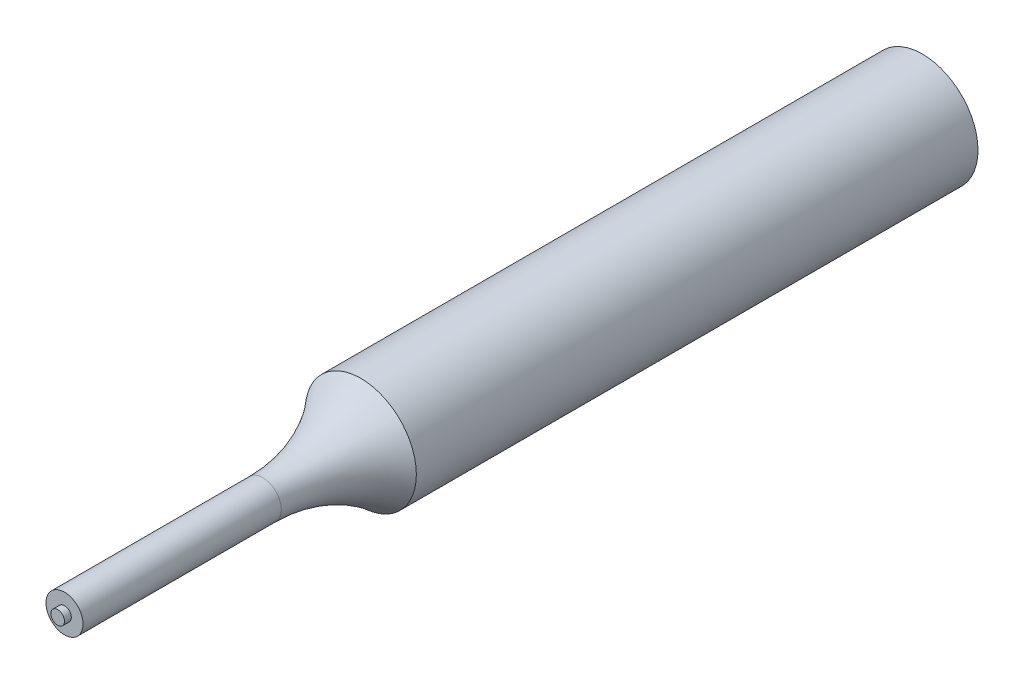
ISO-10303-21;
HEADER;
FILE_DESCRIPTION(('STEP AP214'),'2;1');
FILE_NAME('part.step','',(''),(''),'','','');
FILE_SCHEMA(('AUTOMOTIVE_DESIGN { 1 0 10303 214 1 1 1 1 }'));
ENDSEC;
DATA;
#1=APPLICATION_CONTEXT('core data for automotive mechanical design processes');
#2=APPLICATION_PROTOCOL_DEFINITION('international standard','automotive_design',2000,#1);
#3=PRODUCT_CONTEXT('',#1,'mechanical');
#4=PRODUCT('Part','Part','',(#3));
#5=PRODUCT_RELATED_PRODUCT_CATEGORY('part','',(#4));
#6=PRODUCT_DEFINITION_FORMATION('','',#4);
#7=PRODUCT_DEFINITION_CONTEXT('part definition',#1,'design');
#8=PRODUCT_DEFINITION('design','',#6,#7);
#9=PRODUCT_DEFINITION_SHAPE('','',#8);
#10=(LENGTH_UNIT() NAMED_UNIT(*) SI_UNIT(.MILLI.,.METRE.));
#11=(NAMED_UNIT(*) PLANE_ANGLE_UNIT() SI_UNIT($,.RADIAN.));
#12=(NAMED_UNIT(*) SI_UNIT($,.STERADIAN.) SOLID_ANGLE_UNIT());
#13=UNCERTAINTY_MEASURE_WITH_UNIT(LENGTH_MEASURE(1.E-05),#10,'distance_accuracy_value','');
#14=(GEOMETRIC_REPRESENTATION_CONTEXT(3) GLOBAL_UNCERTAINTY_ASSIGNED_CONTEXT((#13)) GLOBAL_UNIT_ASSIGNED_CONTEXT((#10,
#11,#12)) REPRESENTATION_CONTEXT('',''));
#15=CARTESIAN_POINT('',(0.,0.,0.));
#16=DIRECTION('',(0.,0.,1.));
#17=DIRECTION('',(1.,0.,0.));
#18=AXIS2_PLACEMENT_3D('',#15,#16,#17);
#19=CARTESIAN_POINT('',(-4.7625,0.,6.35));
#20=DIRECTION('',(0.,0.,1.));
#21=DIRECTION('',(1.,0.,0.));
#22=AXIS2_PLACEMENT_3D('',#19,#20,#21);
#23=PLANE('',#22);
#24=CARTESIAN_POINT('',(0.,0.,6.35));
#25=DIRECTION('',(0.,0.,1.));
#26=DIRECTION('',(1.,0.,0.));
#27=AXIS2_PLACEMENT_3D('',#24,#25,#26);
#28=CIRCLE('',#27,4.7625);
#29=CARTESIAN_POINT('',(4.7625,0.,6.35));
#30=VERTEX_POINT('',#29);
#31=EDGE_CURVE('E64',#30,#30,#28,.T.);
#32=ORIENTED_EDGE('',*,*,#31,.F.);
#33=EDGE_LOOP('',(#32));
#34=FACE_BOUND('',#33,.T.);
#35=ADVANCED_FACE('F41',(#34),#23,.F.);
#36=CARTESIAN_POINT('',(0.,0.,43.5171681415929));
#37=DIRECTION('',(0.,0.,1.));
#38=DIRECTION('',(1.,0.,0.));
#39=AXIS2_PLACEMENT_3D('',#36,#37,#38);
#40=CYLINDRICAL_SURFACE('',#39,4.7625);
#41=CARTESIAN_POINT('',(-4.00248276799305,-2.58099553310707,25.5899742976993));
#42=CARTESIAN_POINT('',(-4.02522274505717,-2.54572828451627,25.4458852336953));
#43=CARTESIAN_POINT('',(-4.04766248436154,-2.50991005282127,25.3018835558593));
#44=CARTESIAN_POINT('',(-4.09193875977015,-2.43706039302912,25.0140898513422));
#45=CARTESIAN_POINT('',(-4.11377527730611,-2.40002892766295,24.8702978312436));
#46=CARTESIAN_POINT('',(-4.17842422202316,-2.2868629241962,24.4389656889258));
#47=CARTESIAN_POINT('',(-4.22032281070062,-2.20873878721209,24.1518068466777));
#48=CARTESIAN_POINT('',(-4.30289135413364,-2.04337310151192,23.5701936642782));
#49=CARTESIAN_POINT('',(-4.34348400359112,-1.95592516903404,23.2757862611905));
#50=CARTESIAN_POINT('',(-4.4023152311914,-1.81755804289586,22.8362623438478));
#51=CARTESIAN_POINT('',(-4.42157721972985,-1.77025171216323,22.6901456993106));
#52=CARTESIAN_POINT('',(-4.45939906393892,-1.67269546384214,22.3988113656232));
#53=CARTESIAN_POINT('',(-4.47795895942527,-1.6224457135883,22.2535936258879));
#54=CARTESIAN_POINT('',(-4.51421091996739,-1.51865377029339,21.9654674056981));
#55=CARTESIAN_POINT('',(-4.53190845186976,-1.46513911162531,21.8225497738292));
#56=CARTESIAN_POINT('',(-4.5665462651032,-1.35332620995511,21.5383567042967));
#57=CARTESIAN_POINT('',(-4.58348590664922,-1.29502403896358,21.3970827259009));
#58=CARTESIAN_POINT('',(-4.61637705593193,-1.17239285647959,21.1183156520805));
#59=CARTESIAN_POINT('',(-4.63233524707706,-1.10811446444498,20.9808016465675));
#60=CARTESIAN_POINT('',(-4.65547688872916,-1.00457578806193,20.7781751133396));
#61=CARTESIAN_POINT('',(-4.66305359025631,-0.968901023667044,20.7112817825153));
#62=CARTESIAN_POINT('',(-4.67789630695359,-0.894504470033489,20.5791865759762));
#63=CARTESIAN_POINT('',(-4.68516243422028,-0.8557837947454,20.5139840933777));
#64=CARTESIAN_POINT('',(-4.69900506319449,-0.77609500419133,20.3887909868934));
#65=CARTESIAN_POINT('',(-4.70559777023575,-0.735293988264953,20.3286967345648));
#66=CARTESIAN_POINT('',(-4.7183147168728,-0.648721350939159,20.2119385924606));
#67=CARTESIAN_POINT('',(-4.72443847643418,-0.602944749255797,20.1552782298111));
#68=CARTESIAN_POINT('',(-4.73461183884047,-0.516039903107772,20.0605266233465));
#69=CARTESIAN_POINT('',(-4.73881233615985,-0.476312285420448,20.0211841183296));
#70=CARTESIAN_POINT('',(-4.74655370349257,-0.391706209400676,19.9483523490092));
#71=CARTESIAN_POINT('',(-4.75009652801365,-0.346843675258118,19.9148457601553));
#72=CARTESIAN_POINT('',(-4.75485366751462,-0.271185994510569,19.8697074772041));
#73=CARTESIAN_POINT('',(-4.75642103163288,-0.24239522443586,19.8547986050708));
#74=CARTESIAN_POINT('',(-4.75908055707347,-0.182874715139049,19.8294654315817));
#75=CARTESIAN_POINT('',(-4.76017339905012,-0.152147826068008,19.8190347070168));
#76=CARTESIAN_POINT('',(-4.7617760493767,-0.0888993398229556,19.8037279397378));
#77=CARTESIAN_POINT('',(-4.7622789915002,-0.0563611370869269,19.7989173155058));
#78=CARTESIAN_POINT('',(-4.76260340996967,0.00902995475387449,19.7958150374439));
#79=CARTESIAN_POINT('',(-4.76242519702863,0.0418826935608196,19.7975204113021));
#80=CARTESIAN_POINT('',(-4.76148382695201,0.102334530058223,19.8065183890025));
#81=CARTESIAN_POINT('',(-4.76080084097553,0.130055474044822,19.8130451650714));
#82=CARTESIAN_POINT('',(-4.7590133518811,0.184209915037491,19.8301024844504));
#83=CARTESIAN_POINT('',(-4.75790856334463,0.210642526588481,19.8406357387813));
#84=CARTESIAN_POINT('',(-4.75451686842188,0.278927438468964,19.8729125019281));
#85=CARTESIAN_POINT('',(-4.75193127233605,0.319424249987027,19.8974639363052));
#86=CARTESIAN_POINT('',(-4.74613891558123,0.396318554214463,19.9522424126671));
#87=CARTESIAN_POINT('',(-4.74293008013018,0.432701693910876,19.9824884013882));
#88=CARTESIAN_POINT('',(-4.73499245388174,0.513203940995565,20.0569725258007));
#89=CARTESIAN_POINT('',(-4.73010748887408,0.556026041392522,20.1025746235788));
#90=CARTESIAN_POINT('',(-4.71986086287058,0.637172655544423,20.1976168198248));
#91=CARTESIAN_POINT('',(-4.71449821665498,0.675487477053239,20.2470648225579));
#92=CARTESIAN_POINT('',(-4.70340177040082,0.748866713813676,20.3487083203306));
#93=CARTESIAN_POINT('',(-4.69766592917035,0.78391015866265,20.400918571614));
#94=CARTESIAN_POINT('',(-4.68593561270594,0.851218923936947,20.5069737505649));
#95=CARTESIAN_POINT('',(-4.67994141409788,0.883487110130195,20.5608169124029));
#96=CARTESIAN_POINT('',(-4.66114450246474,0.979561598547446,20.7285108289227));
#97=CARTESIAN_POINT('',(-4.64798059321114,1.0397891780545,20.8443637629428));
#98=CARTESIAN_POINT('',(-4.62093036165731,1.15404642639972,21.0790294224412));
#99=CARTESIAN_POINT('',(-4.60704349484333,1.20807132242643,21.1978443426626));
#100=CARTESIAN_POINT('',(-4.57861833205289,1.31169886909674,21.4376273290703));
#101=CARTESIAN_POINT('',(-4.56407861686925,1.36129110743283,21.558599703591));
#102=CARTESIAN_POINT('',(-4.53443167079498,1.45699481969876,21.8018508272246));
#103=CARTESIAN_POINT('',(-4.51932436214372,1.50310581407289,21.9241297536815));
#104=CARTESIAN_POINT('',(-4.47317602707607,1.63741284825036,22.2925795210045));
#105=CARTESIAN_POINT('',(-4.44133411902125,1.7214933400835,22.5401476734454));
#106=CARTESIAN_POINT('',(-4.37570545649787,1.88203802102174,23.0370801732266));
#107=CARTESIAN_POINT('',(-4.34192128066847,1.95851195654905,23.2864417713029));
#108=CARTESIAN_POINT('',(-4.2834523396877,2.08243229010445,23.7072575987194));
#109=CARTESIAN_POINT('',(-4.25927962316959,2.13139306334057,23.8783397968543));
#110=CARTESIAN_POINT('',(-4.21004355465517,2.22706881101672,24.2210676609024));
#111=CARTESIAN_POINT('',(-4.1849798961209,2.27378299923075,24.3927135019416));
#112=CARTESIAN_POINT('',(-4.1341642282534,2.36490929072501,24.7351547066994));
#113=CARTESIAN_POINT('',(-4.1084185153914,2.40933561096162,24.9059472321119));
#114=CARTESIAN_POINT('',(-4.05608365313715,2.496429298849,25.2477782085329));
#115=CARTESIAN_POINT('',(-4.02949484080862,2.53909735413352,25.4188165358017));
#116=CARTESIAN_POINT('',(-4.00248276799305,2.58099553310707,25.5899742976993));
#117=B_SPLINE_CURVE_WITH_KNOTS('',3,(#41,#42,#43,#44,#45,#46,#47,#48,#49,#50,#51,#52,#53,#54,
#55,#56,#57,#58,#59,#60,#61,#62,#63,#64,#65,#66,#67,#68,#69,#70,#71,#72,#73,#74,#75,#76,#77,#78,
#79,#80,#81,#82,#83,#84,#85,#86,#87,#88,#89,#90,#91,#92,#93,#94,#95,#96,#97,#98,#99,#100,#101,
#102,#103,#104,#105,#106,#107,#108,#109,#110,#111,#112,#113,#114,#115,#116),.UNSPECIFIED.,.F.,
.F.,(4,2,2,2,2,2,2,2,2,2,2,2,2,2,2,2,2,2,2,2,2,2,2,2,2,2,2,2,2,2,2,2,2,2,2,2,2,4),(0.,
0.450223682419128,0.90046120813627,1.80198981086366,2.73121839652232,3.19555454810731,
3.65986432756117,4.12069011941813,4.58189785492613,5.0395039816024,5.26801623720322,
5.49644530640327,5.71509848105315,5.93397256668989,6.10186830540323,6.269256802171,
6.36634972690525,6.46330291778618,6.5613737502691,6.65939985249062,6.74450925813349,
6.82967635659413,6.97113428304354,7.11307145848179,7.300853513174,7.48903225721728,
7.67834456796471,7.86745898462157,8.26082824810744,8.6544981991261,9.04906982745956,
9.44369571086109,10.2336515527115,11.0225818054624,11.5613172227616,12.1002398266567,
12.6352611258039,13.170071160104),.UNSPECIFIED.);
#118=CARTESIAN_POINT('',(-4.00251433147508,-2.58094658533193,25.5897742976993));
#119=VERTEX_POINT('',#118);
#120=CARTESIAN_POINT('',(-4.00251433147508,2.58094658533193,25.5897742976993));
#121=VERTEX_POINT('',#120);
#122=EDGE_CURVE('E53',#119,#121,#117,.T.);
#123=ORIENTED_EDGE('',*,*,#122,.T.);
#124=CARTESIAN_POINT('',(-4.00254589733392,2.58089763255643,25.5895742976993));
#125=CARTESIAN_POINT('',(-3.98374375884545,2.60998992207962,25.7085089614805));
#126=CARTESIAN_POINT('',(-3.96748136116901,2.63457728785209,25.8289263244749));
#127=CARTESIAN_POINT('',(-3.94038015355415,2.67497554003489,26.0718070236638));
#128=CARTESIAN_POINT('',(-3.92954040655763,2.69078794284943,26.1942700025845));
#129=CARTESIAN_POINT('',(-3.91361109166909,2.71389516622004,26.4405308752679));
#130=CARTESIAN_POINT('',(-3.90852933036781,2.72117842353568,26.5643303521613));
#131=CARTESIAN_POINT('',(-3.90427351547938,2.72728344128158,26.8122429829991));
#132=CARTESIAN_POINT('',(-3.90509966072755,2.7261049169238,26.9363561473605));
#133=CARTESIAN_POINT('',(-3.91263956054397,2.71527160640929,27.1840148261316));
#134=CARTESIAN_POINT('',(-3.9193524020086,2.70561813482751,27.3075604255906));
#135=CARTESIAN_POINT('',(-3.93847587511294,2.67770423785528,27.5532288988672));
#136=CARTESIAN_POINT('',(-3.9508863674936,2.65944402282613,27.6753518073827));
#137=CARTESIAN_POINT('',(-3.98104683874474,2.61408047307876,27.9172203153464));
#138=CARTESIAN_POINT('',(-3.99879400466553,2.58698179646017,28.0369671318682));
#139=CARTESIAN_POINT('',(-4.03908679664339,2.52360498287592,28.2731341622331));
#140=CARTESIAN_POINT('',(-4.06163140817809,2.48732878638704,28.389555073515));
#141=CARTESIAN_POINT('',(-4.12599014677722,2.37984742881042,28.6884472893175));
#142=CARTESIAN_POINT('',(-4.17112887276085,2.30088062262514,28.8675134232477));
#143=CARTESIAN_POINT('',(-4.26800596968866,2.11575024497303,29.2089690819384));
#144=CARTESIAN_POINT('',(-4.31973502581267,2.00962485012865,29.3713815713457));
#145=CARTESIAN_POINT('',(-4.41179643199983,1.79654634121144,29.6377503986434));
#146=CARTESIAN_POINT('',(-4.45197592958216,1.6955473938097,29.7465098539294));
#147=CARTESIAN_POINT('',(-4.52937209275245,1.4763625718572,29.9464000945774));
#148=CARTESIAN_POINT('',(-4.56659240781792,1.35819839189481,30.0375527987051));
#149=CARTESIAN_POINT('',(-4.62821149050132,1.12811168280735,30.1836146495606));
#150=CARTESIAN_POINT('',(-4.65371391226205,1.01875109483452,30.2420791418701));
#151=CARTESIAN_POINT('',(-4.69779369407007,0.790925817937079,30.3413201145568));
#152=CARTESIAN_POINT('',(-4.71637478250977,0.672466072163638,30.3821061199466));
#153=CARTESIAN_POINT('',(-4.74475995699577,0.428694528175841,30.443858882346));
#154=CARTESIAN_POINT('',(-4.75451473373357,0.303348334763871,30.4647143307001));
#155=CARTESIAN_POINT('',(-4.76390815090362,0.0505595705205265,30.4848051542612));
#156=CARTESIAN_POINT('',(-4.76355020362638,-0.0768822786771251,30.4840478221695));
#157=CARTESIAN_POINT('',(-4.75329311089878,-0.31739221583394,30.4620934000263));
#158=CARTESIAN_POINT('',(-4.74429606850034,-0.430683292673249,30.4428287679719));
#159=CARTESIAN_POINT('',(-4.71894195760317,-0.652253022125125,30.387709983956));
#160=CARTESIAN_POINT('',(-4.7025845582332,-0.760531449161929,30.3518550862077));
#161=CARTESIAN_POINT('',(-4.66330563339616,-0.973175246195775,30.2638488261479));
#162=CARTESIAN_POINT('',(-4.64018762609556,-1.07729822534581,30.2112046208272));
#163=CARTESIAN_POINT('',(-4.58947983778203,-1.27618080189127,30.0922461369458));
#164=CARTESIAN_POINT('',(-4.56188760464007,-1.37093521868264,30.0259243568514));
#165=CARTESIAN_POINT('',(-4.49143364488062,-1.58958928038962,29.8501826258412));
#166=CARTESIAN_POINT('',(-4.44717375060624,-1.70809786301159,29.7346031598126));
#167=CARTESIAN_POINT('',(-4.35815364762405,-1.92395867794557,29.4851764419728));
#168=CARTESIAN_POINT('',(-4.31339259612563,-2.02126682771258,29.3512920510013));
#169=CARTESIAN_POINT('',(-4.24290600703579,-2.16402085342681,29.1208013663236));
#170=CARTESIAN_POINT('',(-4.21613704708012,-2.2155145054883,29.0281636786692));
#171=CARTESIAN_POINT('',(-4.16482653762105,-2.31052950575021,28.8382975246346));
#172=CARTESIAN_POINT('',(-4.14028482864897,-2.35405142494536,28.7410693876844));
#173=CARTESIAN_POINT('',(-4.09409857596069,-2.43349021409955,28.5428191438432));
#174=CARTESIAN_POINT('',(-4.07245623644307,-2.46940130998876,28.4417942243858));
#175=CARTESIAN_POINT('',(-4.03264655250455,-2.53389098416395,28.2368120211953));
#176=CARTESIAN_POINT('',(-4.01447795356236,-2.56247221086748,28.1328558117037));
#177=CARTESIAN_POINT('',(-3.98181382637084,-2.61294496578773,27.9211990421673));
#178=CARTESIAN_POINT('',(-3.96737317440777,-2.63473742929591,27.8134664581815));
#179=CARTESIAN_POINT('',(-3.94284282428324,-2.67130703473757,27.5963625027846));
#180=CARTESIAN_POINT('',(-3.9327519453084,-2.68608608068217,27.4869915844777));
#181=CARTESIAN_POINT('',(-3.91714549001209,-2.70879438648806,27.2672473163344));
#182=CARTESIAN_POINT('',(-3.9116287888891,-2.71672533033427,27.156874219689));
#183=CARTESIAN_POINT('',(-3.90529036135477,-2.72582921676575,26.9357506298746));
#184=CARTESIAN_POINT('',(-3.90446703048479,-2.72700446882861,26.825000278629));
#185=CARTESIAN_POINT('',(-3.90731263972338,-2.72292436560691,26.6192513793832));
#186=CARTESIAN_POINT('',(-3.91036684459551,-2.71854905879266,26.524225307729));
#187=CARTESIAN_POINT('',(-3.91990046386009,-2.70478376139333,26.3347183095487));
#188=CARTESIAN_POINT('',(-3.92637946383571,-2.6953943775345,26.2402373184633));
#189=CARTESIAN_POINT('',(-3.942655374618,-2.67153358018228,26.0522515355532));
#190=CARTESIAN_POINT('',(-3.95245071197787,-2.65706457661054,25.9587463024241));
#191=CARTESIAN_POINT('',(-3.97518478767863,-2.62291841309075,25.7730593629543));
#192=CARTESIAN_POINT('',(-3.98812417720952,-2.60324017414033,25.680877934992));
#193=CARTESIAN_POINT('',(-4.00254589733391,-2.58089763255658,25.5895742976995));
#194=B_SPLINE_CURVE_WITH_KNOTS('',3,(#124,#125,#126,#127,#128,#129,#130,#131,#132,#133,#134,
#135,#136,#137,#138,#139,#140,#141,#142,#143,#144,#145,#146,#147,#148,#149,#150,#151,#152,#153,
#154,#155,#156,#157,#158,#159,#160,#161,#162,#163,#164,#165,#166,#167,#168,#169,#170,#171,#172,
#173,#174,#175,#176,#177,#178,#179,#180,#181,#182,#183,#184,#185,#186,#187,#188,#189,#190,#191,
#192,#193),.UNSPECIFIED.,.F.,.F.,(4,2,2,2,2,2,2,2,2,2,2,2,2,2,2,2,2,2,2,2,2,2,2,2,2,2,2,2,2,2,2,
2,2,2,4),(0.,0.371484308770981,0.742904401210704,1.11482745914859,1.48676303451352,
1.85864092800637,2.23050973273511,2.60218286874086,2.97377748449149,3.57386840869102,
4.17312037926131,4.63274823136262,5.09180014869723,5.47005609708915,5.84810799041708,
6.22825910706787,6.60828195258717,6.95250087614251,7.29673527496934,7.65218390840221,
8.00782801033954,8.51910286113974,9.03143088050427,9.35899799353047,9.6865416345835,
10.0143328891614,10.3420055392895,10.6742571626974,11.0064185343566,11.3384982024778,
11.6704643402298,11.9558029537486,12.2411070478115,12.5262759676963,12.8115040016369),.UNSPECIFIED.);
#195=EDGE_CURVE('E11',#121,#119,#194,.T.);
#196=ORIENTED_EDGE('',*,*,#195,.T.);
#197=EDGE_LOOP('',(#123,#196));
#198=FACE_BOUND('',#197,.T.);
#199=CARTESIAN_POINT('',(0.,0.,54.4957));
#200=DIRECTION('',(0.,0.,1.));
#201=DIRECTION('',(1.,0.,0.));
#202=AXIS2_PLACEMENT_3D('',#199,#200,#201);
#203=CIRCLE('',#202,4.76249999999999);
#204=CARTESIAN_POINT('',(4.76249999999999,0.,54.4957));
#205=VERTEX_POINT('',#204);
#206=EDGE_CURVE('E76',#205,#205,#203,.T.);
#207=ORIENTED_EDGE('',*,*,#206,.F.);
#208=EDGE_LOOP('',(#207));
#209=FACE_BOUND('',#208,.T.);
#210=ORIENTED_EDGE('',*,*,#31,.T.);
#211=EDGE_LOOP('',(#210));
#212=FACE_BOUND('',#211,.T.);
#213=ADVANCED_FACE('F69',(#198,#209,#212),#40,.T.);
#214=CARTESIAN_POINT('',(0.,0.,62.8957299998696));
#215=DIRECTION('',(0.,0.,1.));
#216=DIRECTION('',(1.,0.,0.));
#217=AXIS2_PLACEMENT_3D('',#214,#215,#216);
#218=TOROIDAL_SURFACE('',#217,14.2877032,12.7);
#219=CARTESIAN_POINT('',(0.,0.,62.8957299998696));
#220=DIRECTION('',(0.,0.,1.));
#221=DIRECTION('',(1.,0.,0.));
#222=AXIS2_PLACEMENT_3D('',#219,#220,#221);
#223=CIRCLE('',#222,1.58770319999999);
#224=CARTESIAN_POINT('',(1.58770319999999,0.,62.8957299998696));
#225=VERTEX_POINT('',#224);
#226=EDGE_CURVE('E81',#225,#225,#223,.T.);
#227=ORIENTED_EDGE('',*,*,#226,.F.);
#228=EDGE_LOOP('',(#227));
#229=FACE_BOUND('',#228,.T.);
#230=ORIENTED_EDGE('',*,*,#206,.T.);
#231=EDGE_LOOP('',(#230));
#232=FACE_BOUND('',#231,.T.);
#233=ADVANCED_FACE('F72',(#229,#232),#218,.F.);
#234=CARTESIAN_POINT('',(0.,0.,43.5171681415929));
#235=DIRECTION('',(0.,0.,1.));
#236=DIRECTION('',(1.,0.,0.));
#237=AXIS2_PLACEMENT_3D('',#234,#235,#236);
#238=CYLINDRICAL_SURFACE('',#237,1.58770319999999);
#239=CARTESIAN_POINT('',(0.,0.,79.8957));
#240=DIRECTION('',(0.,0.,1.));
#241=DIRECTION('',(1.,0.,0.));
#242=AXIS2_PLACEMENT_3D('',#239,#240,#241);
#243=CIRCLE('',#242,1.58770319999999);
#244=CARTESIAN_POINT('',(1.58770319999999,0.,79.8957));
#245=VERTEX_POINT('',#244);
#246=EDGE_CURVE('E87',#245,#245,#243,.T.);
#247=ORIENTED_EDGE('',*,*,#246,.F.);
#248=EDGE_LOOP('',(#247));
#249=FACE_BOUND('',#248,.T.);
#250=ORIENTED_EDGE('',*,*,#226,.T.);
#251=EDGE_LOOP('',(#250));
#252=FACE_BOUND('',#251,.T.);
#253=ADVANCED_FACE('F111',(#249,#252),#238,.T.);
#254=CARTESIAN_POINT('',(0.,0.,79.8957));
#255=DIRECTION('',(0.,0.,-1.));
#256=DIRECTION('',(-1.,0.,0.));
#257=AXIS2_PLACEMENT_3D('',#254,#255,#256);
#258=PLANE('',#257);
#259=CARTESIAN_POINT('',(0.,0.,79.8957));
#260=DIRECTION('',(0.,0.,-1.));
#261=DIRECTION('',(-1.,0.,0.));
#262=AXIS2_PLACEMENT_3D('',#259,#260,#261);
#263=CIRCLE('',#262,0.584200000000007);
#264=CARTESIAN_POINT('',(-0.58419999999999,0.,79.8957));
#265=VERTEX_POINT('',#264);
#266=EDGE_CURVE('E85',#265,#265,#263,.T.);
#267=ORIENTED_EDGE('',*,*,#266,.T.);
#268=EDGE_LOOP('',(#267));
#269=FACE_BOUND('',#268,.T.);
#270=ORIENTED_EDGE('',*,*,#246,.T.);
#271=EDGE_LOOP('',(#270));
#272=FACE_BOUND('',#271,.T.);
#273=ADVANCED_FACE('F104',(#269,#272),#258,.F.);
#274=CARTESIAN_POINT('',(0.,0.,0.));
#275=DIRECTION('',(0.,0.,-1.));
#276=DIRECTION('',(-1.,0.,0.));
#277=AXIS2_PLACEMENT_3D('',#274,#275,#276);
#278=CYLINDRICAL_SURFACE('',#277,0.584200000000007);
#279=CARTESIAN_POINT('',(0.,0.,80.4799));
#280=DIRECTION('',(0.,0.,-1.));
#281=DIRECTION('',(-1.,0.,0.));
#282=AXIS2_PLACEMENT_3D('',#279,#280,#281);
#283=CIRCLE('',#282,0.584200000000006);
#284=CARTESIAN_POINT('',(-0.58419999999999,0.,80.4799));
#285=VERTEX_POINT('',#284);
#286=EDGE_CURVE('E67',#285,#285,#283,.T.);
#287=ORIENTED_EDGE('',*,*,#286,.T.);
#288=EDGE_LOOP('',(#287));
#289=FACE_BOUND('',#288,.T.);
#290=ORIENTED_EDGE('',*,*,#266,.F.);
#291=EDGE_LOOP('',(#290));
#292=FACE_BOUND('',#291,.T.);
#293=ADVANCED_FACE('F101',(#289,#292),#278,.T.);
#294=CARTESIAN_POINT('',(0.,0.,80.4799));
#295=DIRECTION('',(0.,0.,1.));
#296=DIRECTION('',(1.,0.,0.));
#297=AXIS2_PLACEMENT_3D('',#294,#295,#296);
#298=PLANE('',#297);
#299=ORIENTED_EDGE('',*,*,#286,.F.);
#300=EDGE_LOOP('',(#299));
#301=FACE_BOUND('',#300,.T.);
#302=ADVANCED_FACE('F100',(#301),#298,.T.);
#303=CARTESIAN_POINT('',(-7.8105,0.,26.8224));
#304=DIRECTION('',(0.,0.,-1.));
#305=DIRECTION('',(-1.,0.,0.));
#306=AXIS2_PLACEMENT_3D('',#303,#304,#305);
#307=SPHERICAL_SURFACE('',#306,4.7625);
#308=CARTESIAN_POINT('',(-7.81049999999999,0.,25.5897742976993));
#309=DIRECTION('',(0.,0.,-1.));
#310=DIRECTION('',(-1.,0.,0.));
#311=AXIS2_PLACEMENT_3D('',#308,#309,#310);
#312=CIRCLE('',#311,4.6002217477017);
#313=EDGE_CURVE('E59',#121,#119,#312,.T.);
#314=ORIENTED_EDGE('',*,*,#313,.T.);
#315=ORIENTED_EDGE('',*,*,#195,.F.);
#316=EDGE_LOOP('',(#314,#315));
#317=FACE_BOUND('',#316,.T.);
#318=ADVANCED_FACE('F66',(#317),#307,.F.);
#319=CARTESIAN_POINT('',(-7.8105,0.,8.42151300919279));
#320=DIRECTION('',(0.,0.,1.));
#321=DIRECTION('',(1.,0.,0.));
#322=AXIS2_PLACEMENT_3D('',#319,#320,#321);
#323=CONICAL_SURFACE('',#322,0.,0.261799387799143);
#324=ORIENTED_EDGE('',*,*,#313,.F.);
#325=ORIENTED_EDGE('',*,*,#122,.F.);
#326=EDGE_LOOP('',(#324,#325));
#327=FACE_BOUND('',#326,.T.);
#328=ADVANCED_FACE('F62',(#327),#323,.F.);
#329=CLOSED_SHELL('',(#35,#213,#233,#253,#273,#293,#302,#318,#328));
#330=MANIFOLD_SOLID_BREP('B2',#329);
#331=ADVANCED_BREP_SHAPE_REPRESENTATION('',(#18,#330),#14);
#332=SHAPE_DEFINITION_REPRESENTATION(#9,#331);
ENDSEC;
END-ISO-10303-21;
